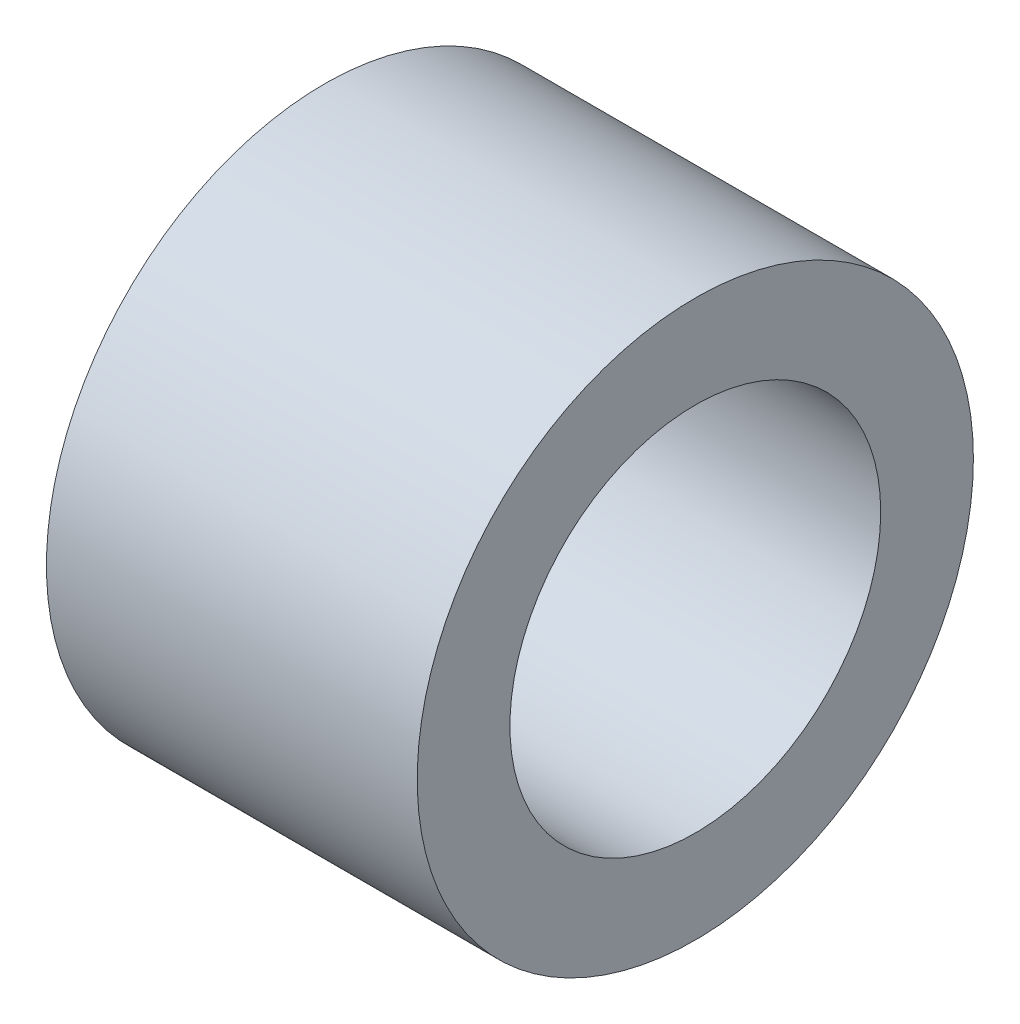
from build123d import *

# Parameters (mm, degrees)
SKETCH1_R           = 4.7625
SKETCH1_R_2         = 3.175
BOSS_EXTRUDE1_DEPTH = 6.35


with BuildPart() as part:
    # Sketch1 → Boss-Extrude1 (new body)
    with BuildSketch(Plane.YZ):
        with Locations(Location((0, 0, 0), (0, 0, 270))):
            Circle(SKETCH1_R)
        with Locations(Location((0, 0, 0), (0, 0, 270))):
            Circle(SKETCH1_R_2, mode=Mode.SUBTRACT)
    extrude(amount=BOSS_EXTRUDE1_DEPTH)


solid = part.part
